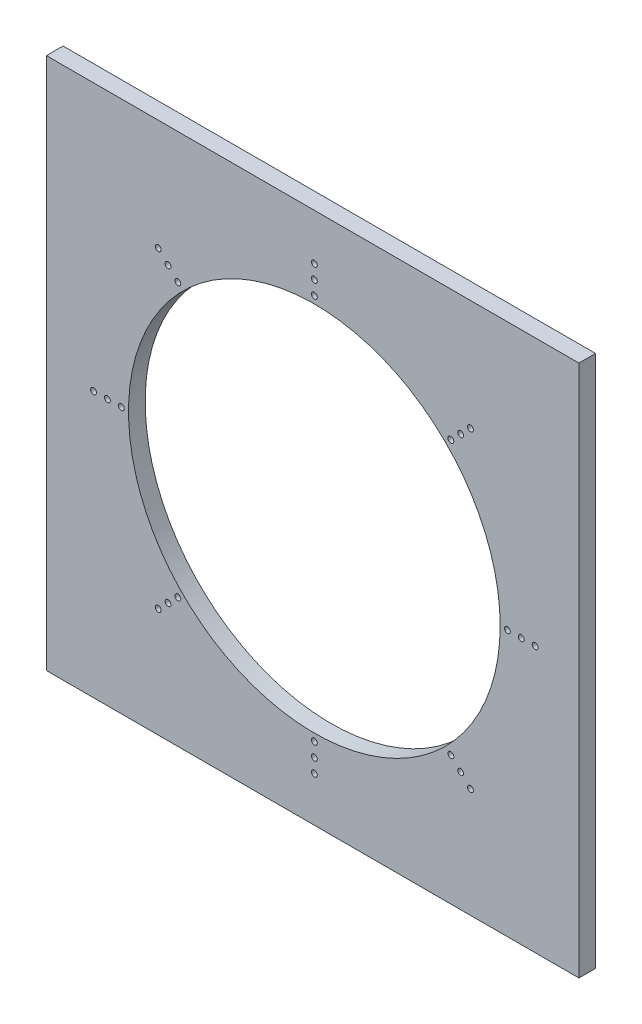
from build123d import *

# Parameters (mm, degrees)
SKETCH1_W           = 609.6
SKETCH1_H           = 609.6
BOSS_EXTRUDE1_DEPTH = 19.05
SKETCH2_R           = 3.3655
SKETCH2_R_2         = 212.725
CUT_EXTRUDE1_DEPTH  = 432.473037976
SKETCH3_R           = 3.3655
CUT_EXTRUDE2_DEPTH  = 432.473037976
SKETCH4_R           = 5.55625
CUT_EXTRUDE3_DEPTH  = 6.35
CIRPATTERN1_COUNT   = 8


with BuildPart() as part:
    # Sketch1 → Boss-Extrude1 (new body)
    with BuildSketch(Plane.XY):
        Rectangle(SKETCH1_W, SKETCH1_H)
    extrude(amount=BOSS_EXTRUDE1_DEPTH)

    # Sketch2 → Cut-Extrude1 (cut, through all)
    with BuildSketch(Plane.XY.offset(19.05)):
        with Locations((1.909125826, 220.236669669)):
            Circle(SKETCH2_R)
        with Locations((158.179950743, 155.507174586)):
            Circle(SKETCH2_R)
        with Locations((222.909445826, -0.763650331)):
            Circle(SKETCH2_R)
        with Locations((158.179950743, -157.034475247)):
            Circle(SKETCH2_R)
        with Locations((1.909125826, -221.763970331)):
            Circle(SKETCH2_R)
        with Locations((-154.36169909, -157.034475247)):
            Circle(SKETCH2_R)
        with Locations((-219.091194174, -0.763650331)):
            Circle(SKETCH2_R)
        with Locations((-154.36169909, 155.507174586)):
            Circle(SKETCH2_R)
        with Locations((1.909125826, -0.763650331)):
            Circle(SKETCH2_R_2)
    extrude(amount=-CUT_EXTRUDE1_DEPTH, mode=Mode.SUBTRACT)

    # Sketch3 → Cut-Extrude2 (cut, through all)
    with BuildSketch(Plane(origin=(0, 0, 0), x_dir=(-1, 0, 0), z_dir=(0, 0, -1))):
        with Locations((-1.909125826, 236.111669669)):
            Circle(SKETCH3_R)
        with Locations((-1.909125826, 251.986669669)):
            Circle(SKETCH3_R)
    cut_extrude2 = extrude(amount=-CUT_EXTRUDE2_DEPTH, mode=Mode.SUBTRACT)

    # Sketch4 → Cut-Extrude3 (cut)
    with BuildSketch(Plane(origin=(0, 0, 0), x_dir=(-1, 0, 0), z_dir=(0, 0, -1))):
        with Locations((-1.909125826, 251.986669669)):
            Circle(SKETCH4_R)
        with Locations((-1.909125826, 236.111669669)):
            Circle(SKETCH4_R)
    cut_extrude3 = extrude(amount=-CUT_EXTRUDE3_DEPTH, mode=Mode.SUBTRACT)

    # CirPattern1: Cut-Extrude2, Cut-Extrude3 ×8 about axis
    cirpattern1_axis = Axis((1.909125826, -0.763650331, 0), (0, 0, 1))
    add([cut_extrude2.rotate(cirpattern1_axis, i * 360 / CIRPATTERN1_COUNT) for i in range(1, CIRPATTERN1_COUNT)], mode=Mode.SUBTRACT)
    add([cut_extrude3.rotate(cirpattern1_axis, i * 360 / CIRPATTERN1_COUNT) for i in range(1, CIRPATTERN1_COUNT)], mode=Mode.SUBTRACT)


solid = part.part
